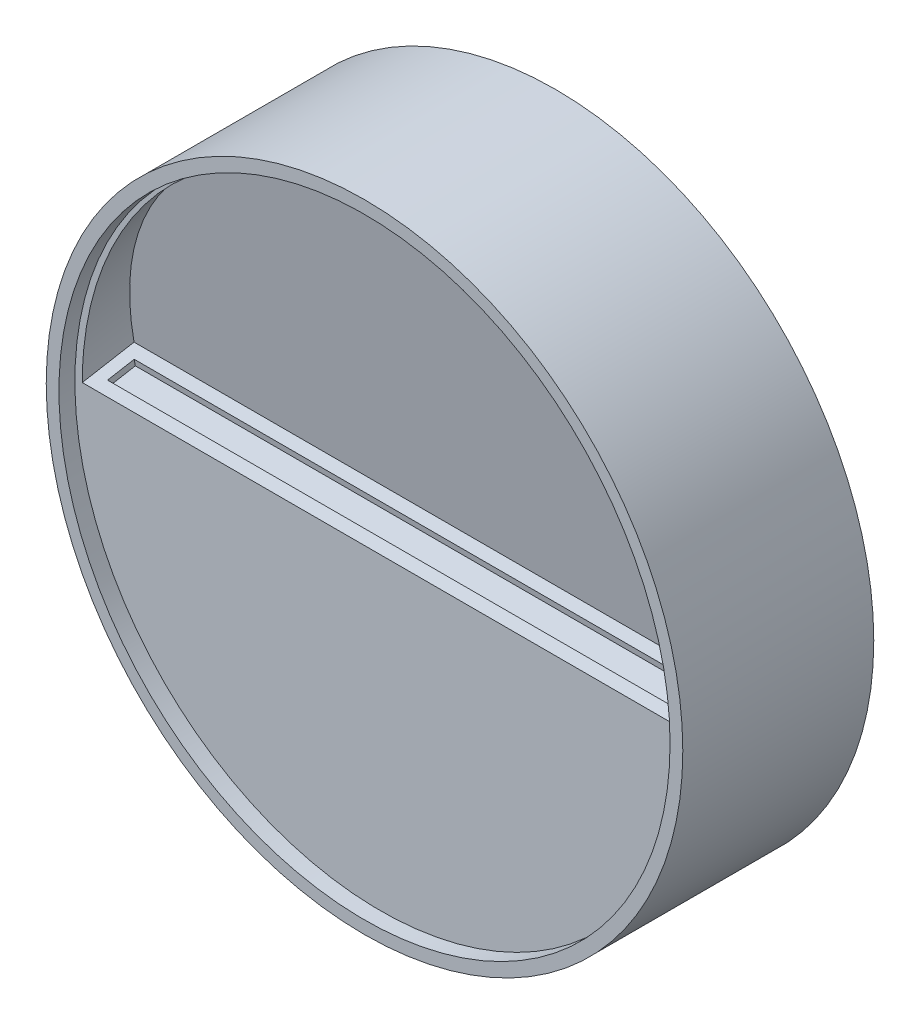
from build123d import *

# Parameters (mm, degrees)
CROQUIS2_R              = 50
SALIENTE_EXTRUIR1_DEPTH = 30
CROQUIS3_R              = 48
CORTAR_EXTRUIR1_DEPTH   = 2.5
CORTAR_EXTRUIR2_DEPTH   = 76.345827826
CROQUIS8_W              = 89.6733034
CROQUIS8_H              = 4.258565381
CORTAR_EXTRUIR3_DEPTH   = 1


with BuildPart() as part:
    # Croquis2 → Saliente-Extruir1 (new body)
    with BuildSketch(Plane.XY):
        Circle(CROQUIS2_R)
    extrude(amount=SALIENTE_EXTRUIR1_DEPTH)

    # Croquis3 → Cortar-Extruir1 (cut)
    with BuildSketch(Plane.XY.offset(30)):
        Circle(CROQUIS3_R)
    extrude(amount=-CORTAR_EXTRUIR1_DEPTH, mode=Mode.SUBTRACT)

    # Croquis7 → Cortar-Extruir2 (cut, through all)
    with BuildSketch(Plane(origin=(0, -3.25539987, 18.462290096), x_dir=(-1, 0, 0), z_dir=(0, -0.17364817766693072, 0.984807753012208))):
        with BuildLine():
            Line((46.8366517, -5.20944533), (-46.8366517, -5.20944533))
            ThreePointArc((-46.8366517, -5.20944533), (0, -52.04609703), (46.8366517, -5.20944533))
        make_face()
    extrude(amount=CORTAR_EXTRUIR2_DEPTH, mode=Mode.SUBTRACT)

    # Croquis8 → Cortar-Extruir3 (cut)
    with BuildSketch(Plane(origin=(0, 5.13030215, 0.904610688), x_dir=(1, 0, 0), z_dir=(0, 0.9848077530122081, 0.17364817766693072))):
        with Locations((0, -22.876383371)):
            Rectangle(CROQUIS8_W, CROQUIS8_H)
    extrude(amount=-CORTAR_EXTRUIR3_DEPTH, mode=Mode.SUBTRACT)


solid = part.part
